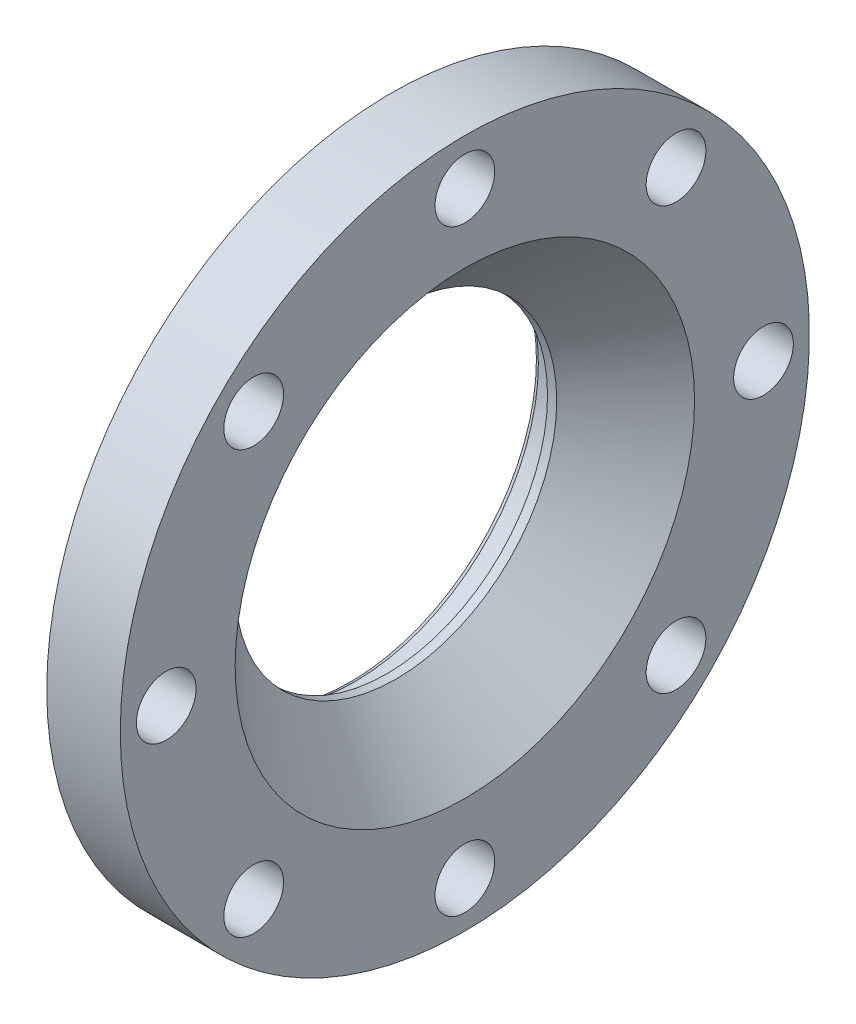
ISO-10303-21;
HEADER;
FILE_DESCRIPTION(('STEP AP214'),'2;1');
FILE_NAME('part.step','',(''),(''),'','','');
FILE_SCHEMA(('AUTOMOTIVE_DESIGN { 1 0 10303 214 1 1 1 1 }'));
ENDSEC;
DATA;
#1=APPLICATION_CONTEXT('core data for automotive mechanical design processes');
#2=APPLICATION_PROTOCOL_DEFINITION('international standard','automotive_design',2000,#1);
#3=PRODUCT_CONTEXT('',#1,'mechanical');
#4=PRODUCT('Part','Part','',(#3));
#5=PRODUCT_RELATED_PRODUCT_CATEGORY('part','',(#4));
#6=PRODUCT_DEFINITION_FORMATION('','',#4);
#7=PRODUCT_DEFINITION_CONTEXT('part definition',#1,'design');
#8=PRODUCT_DEFINITION('design','',#6,#7);
#9=PRODUCT_DEFINITION_SHAPE('','',#8);
#10=(LENGTH_UNIT() NAMED_UNIT(*) SI_UNIT(.MILLI.,.METRE.));
#11=(NAMED_UNIT(*) PLANE_ANGLE_UNIT() SI_UNIT($,.RADIAN.));
#12=(NAMED_UNIT(*) SI_UNIT($,.STERADIAN.) SOLID_ANGLE_UNIT());
#13=UNCERTAINTY_MEASURE_WITH_UNIT(LENGTH_MEASURE(1.E-05),#10,'distance_accuracy_value','');
#14=(GEOMETRIC_REPRESENTATION_CONTEXT(3) GLOBAL_UNCERTAINTY_ASSIGNED_CONTEXT((#13)) GLOBAL_UNIT_ASSIGNED_CONTEXT((#10,
#11,#12)) REPRESENTATION_CONTEXT('',''));
#15=CARTESIAN_POINT('',(0.,0.,0.));
#16=DIRECTION('',(0.,0.,1.));
#17=DIRECTION('',(1.,0.,0.));
#18=AXIS2_PLACEMENT_3D('',#15,#16,#17);
#19=CARTESIAN_POINT('',(0.,0.,0.));
#20=DIRECTION('',(-1.,0.,0.));
#21=DIRECTION('',(0.,0.,1.));
#22=AXIS2_PLACEMENT_3D('',#19,#20,#21);
#23=CYLINDRICAL_SURFACE('',#22,55.);
#24=CARTESIAN_POINT('',(0.,0.,0.));
#25=DIRECTION('',(-1.,0.,0.));
#26=DIRECTION('',(0.,0.,1.));
#27=AXIS2_PLACEMENT_3D('',#24,#25,#26);
#28=CIRCLE('',#27,55.);
#29=CARTESIAN_POINT('',(0.,0.,55.));
#30=VERTEX_POINT('',#29);
#31=EDGE_CURVE('E39',#30,#30,#28,.T.);
#32=ORIENTED_EDGE('',*,*,#31,.F.);
#33=EDGE_LOOP('',(#32));
#34=FACE_BOUND('',#33,.T.);
#35=CARTESIAN_POINT('',(3.,0.,0.));
#36=DIRECTION('',(-1.,0.,0.));
#37=DIRECTION('',(0.,0.,1.));
#38=AXIS2_PLACEMENT_3D('',#35,#36,#37);
#39=CIRCLE('',#38,55.);
#40=CARTESIAN_POINT('',(3.,0.,55.));
#41=VERTEX_POINT('',#40);
#42=EDGE_CURVE('E77',#41,#41,#39,.T.);
#43=ORIENTED_EDGE('',*,*,#42,.T.);
#44=EDGE_LOOP('',(#43));
#45=FACE_BOUND('',#44,.T.);
#46=ADVANCED_FACE('F29',(#34,#45),#23,.T.);
#47=CARTESIAN_POINT('',(0.,47.5,0.));
#48=DIRECTION('',(1.,0.,0.));
#49=DIRECTION('',(0.,0.,-1.));
#50=AXIS2_PLACEMENT_3D('',#47,#48,#49);
#51=PLANE('',#50);
#52=CARTESIAN_POINT('',(0.,0.,0.));
#53=DIRECTION('',(-1.,0.,0.));
#54=DIRECTION('',(0.,0.,1.));
#55=AXIS2_PLACEMENT_3D('',#52,#53,#54);
#56=CIRCLE('',#55,47.5);
#57=CARTESIAN_POINT('',(0.,0.,47.5));
#58=VERTEX_POINT('',#57);
#59=EDGE_CURVE('E43',#58,#58,#56,.T.);
#60=ORIENTED_EDGE('',*,*,#59,.F.);
#61=EDGE_LOOP('',(#60));
#62=FACE_BOUND('',#61,.T.);
#63=ORIENTED_EDGE('',*,*,#31,.T.);
#64=EDGE_LOOP('',(#63));
#65=FACE_BOUND('',#64,.T.);
#66=ADVANCED_FACE('F187',(#62,#65),#51,.F.);
#67=CARTESIAN_POINT('',(0.,0.,0.));
#68=DIRECTION('',(-1.,0.,0.));
#69=DIRECTION('',(0.,0.,1.));
#70=AXIS2_PLACEMENT_3D('',#67,#68,#69);
#71=CYLINDRICAL_SURFACE('',#70,47.5);
#72=CARTESIAN_POINT('',(3.,0.,0.));
#73=DIRECTION('',(-1.,0.,0.));
#74=DIRECTION('',(0.,0.,1.));
#75=AXIS2_PLACEMENT_3D('',#72,#73,#74);
#76=CIRCLE('',#75,47.5);
#77=CARTESIAN_POINT('',(3.,0.,47.5));
#78=VERTEX_POINT('',#77);
#79=EDGE_CURVE('E81',#78,#78,#76,.T.);
#80=ORIENTED_EDGE('',*,*,#79,.F.);
#81=EDGE_LOOP('',(#80));
#82=FACE_BOUND('',#81,.T.);
#83=ORIENTED_EDGE('',*,*,#59,.T.);
#84=EDGE_LOOP('',(#83));
#85=FACE_BOUND('',#84,.T.);
#86=ADVANCED_FACE('F184',(#82,#85),#71,.F.);
#87=CARTESIAN_POINT('',(3.,40.,0.));
#88=DIRECTION('',(1.,0.,0.));
#89=DIRECTION('',(0.,0.,-1.));
#90=AXIS2_PLACEMENT_3D('',#87,#88,#89);
#91=PLANE('',#90);
#92=CARTESIAN_POINT('',(3.,0.,0.));
#93=DIRECTION('',(1.,0.,0.));
#94=DIRECTION('',(0.,0.,-1.));
#95=AXIS2_PLACEMENT_3D('',#92,#93,#94);
#96=CIRCLE('',#95,40.5773502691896);
#97=CARTESIAN_POINT('',(3.,0.,-40.5773502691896));
#98=VERTEX_POINT('',#97);
#99=EDGE_CURVE('E10',#98,#98,#96,.T.);
#100=ORIENTED_EDGE('',*,*,#99,.T.);
#101=EDGE_LOOP('',(#100));
#102=FACE_BOUND('',#101,.T.);
#103=ORIENTED_EDGE('',*,*,#79,.T.);
#104=EDGE_LOOP('',(#103));
#105=FACE_BOUND('',#104,.T.);
#106=ADVANCED_FACE('F179',(#102,#105),#91,.F.);
#107=CARTESIAN_POINT('',(0.,0.,0.));
#108=DIRECTION('',(-1.,0.,0.));
#109=DIRECTION('',(0.,0.,1.));
#110=AXIS2_PLACEMENT_3D('',#107,#108,#109);
#111=CYLINDRICAL_SURFACE('',#110,40.);
#112=CARTESIAN_POINT('',(4.00000000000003,0.,0.));
#113=DIRECTION('',(1.,0.,0.));
#114=DIRECTION('',(0.,0.,-1.));
#115=AXIS2_PLACEMENT_3D('',#112,#113,#114);
#116=CIRCLE('',#115,40.);
#117=CARTESIAN_POINT('',(4.00000000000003,0.,-40.));
#118=VERTEX_POINT('',#117);
#119=EDGE_CURVE('E35',#118,#118,#116,.F.);
#120=ORIENTED_EDGE('',*,*,#119,.T.);
#121=EDGE_LOOP('',(#120));
#122=FACE_BOUND('',#121,.T.);
#123=CARTESIAN_POINT('',(11.,0.,0.));
#124=DIRECTION('',(-1.,0.,0.));
#125=DIRECTION('',(0.,0.,1.));
#126=AXIS2_PLACEMENT_3D('',#123,#124,#125);
#127=CIRCLE('',#126,40.);
#128=CARTESIAN_POINT('',(11.,0.,40.));
#129=VERTEX_POINT('',#128);
#130=EDGE_CURVE('E84',#129,#129,#127,.T.);
#131=ORIENTED_EDGE('',*,*,#130,.F.);
#132=EDGE_LOOP('',(#131));
#133=FACE_BOUND('',#132,.T.);
#134=ADVANCED_FACE('F174',(#122,#133),#111,.F.);
#135=CARTESIAN_POINT('',(11.,35.,0.));
#136=DIRECTION('',(1.,0.,0.));
#137=DIRECTION('',(0.,0.,-1.));
#138=AXIS2_PLACEMENT_3D('',#135,#136,#137);
#139=PLANE('',#138);
#140=CARTESIAN_POINT('',(11.,0.,0.));
#141=DIRECTION('',(-1.,0.,0.));
#142=DIRECTION('',(0.,0.,1.));
#143=AXIS2_PLACEMENT_3D('',#140,#141,#142);
#144=CIRCLE('',#143,35.);
#145=CARTESIAN_POINT('',(11.,0.,35.));
#146=VERTEX_POINT('',#145);
#147=EDGE_CURVE('E87',#146,#146,#144,.T.);
#148=ORIENTED_EDGE('',*,*,#147,.F.);
#149=EDGE_LOOP('',(#148));
#150=FACE_BOUND('',#149,.T.);
#151=ORIENTED_EDGE('',*,*,#130,.T.);
#152=EDGE_LOOP('',(#151));
#153=FACE_BOUND('',#152,.T.);
#154=ADVANCED_FACE('F168',(#150,#153),#139,.F.);
#155=CARTESIAN_POINT('',(0.,0.,0.));
#156=DIRECTION('',(-1.,0.,0.));
#157=DIRECTION('',(0.,0.,1.));
#158=AXIS2_PLACEMENT_3D('',#155,#156,#157);
#159=CYLINDRICAL_SURFACE('',#158,35.);
#160=CARTESIAN_POINT('',(13.,0.,0.));
#161=DIRECTION('',(-1.,0.,0.));
#162=DIRECTION('',(0.,0.,1.));
#163=AXIS2_PLACEMENT_3D('',#160,#161,#162);
#164=CIRCLE('',#163,35.);
#165=CARTESIAN_POINT('',(13.,0.,35.));
#166=VERTEX_POINT('',#165);
#167=EDGE_CURVE('E90',#166,#166,#164,.T.);
#168=ORIENTED_EDGE('',*,*,#167,.F.);
#169=EDGE_LOOP('',(#168));
#170=FACE_BOUND('',#169,.T.);
#171=ORIENTED_EDGE('',*,*,#147,.T.);
#172=EDGE_LOOP('',(#171));
#173=FACE_BOUND('',#172,.T.);
#174=ADVANCED_FACE('F162',(#170,#173),#159,.F.);
#175=CARTESIAN_POINT('',(13.,0.,0.));
#176=DIRECTION('',(1.,0.,0.));
#177=DIRECTION('',(0.,0.,-1.));
#178=AXIS2_PLACEMENT_3D('',#175,#176,#177);
#179=CONICAL_SURFACE('',#178,35.,0.785398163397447);
#180=CARTESIAN_POINT('',(28.,0.,0.));
#181=DIRECTION('',(-1.,0.,0.));
#182=DIRECTION('',(0.,0.,1.));
#183=AXIS2_PLACEMENT_3D('',#180,#181,#182);
#184=CIRCLE('',#183,50.);
#185=CARTESIAN_POINT('',(28.,0.,50.));
#186=VERTEX_POINT('',#185);
#187=EDGE_CURVE('E93',#186,#186,#184,.T.);
#188=ORIENTED_EDGE('',*,*,#187,.F.);
#189=EDGE_LOOP('',(#188));
#190=FACE_BOUND('',#189,.T.);
#191=ORIENTED_EDGE('',*,*,#167,.T.);
#192=EDGE_LOOP('',(#191));
#193=FACE_BOUND('',#192,.T.);
#194=ADVANCED_FACE('F140',(#190,#193),#179,.F.);
#195=CARTESIAN_POINT('',(28.,75.,0.));
#196=DIRECTION('',(-1.,0.,0.));
#197=DIRECTION('',(0.,0.,1.));
#198=AXIS2_PLACEMENT_3D('',#195,#196,#197);
#199=PLANE('',#198);
#200=CARTESIAN_POINT('',(28.,45.9619407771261,45.961940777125));
#201=DIRECTION('',(1.,0.,0.));
#202=DIRECTION('',(0.,0.,-1.));
#203=AXIS2_PLACEMENT_3D('',#200,#201,#202);
#204=CIRCLE('',#203,6.5);
#205=CARTESIAN_POINT('',(28.,45.9619407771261,39.461940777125));
#206=VERTEX_POINT('',#205);
#207=EDGE_CURVE('E50',#206,#206,#204,.T.);
#208=ORIENTED_EDGE('',*,*,#207,.F.);
#209=EDGE_LOOP('',(#208));
#210=FACE_BOUND('',#209,.T.);
#211=CARTESIAN_POINT('',(28.,6.8083925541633E-13,65.));
#212=DIRECTION('',(1.,0.,0.));
#213=DIRECTION('',(0.,0.,-1.));
#214=AXIS2_PLACEMENT_3D('',#211,#212,#213);
#215=CIRCLE('',#214,6.5);
#216=CARTESIAN_POINT('',(28.,6.8083925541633E-13,58.5));
#217=VERTEX_POINT('',#216);
#218=EDGE_CURVE('E49',#217,#217,#215,.T.);
#219=ORIENTED_EDGE('',*,*,#218,.F.);
#220=EDGE_LOOP('',(#219));
#221=FACE_BOUND('',#220,.T.);
#222=CARTESIAN_POINT('',(28.,-45.9619407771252,45.961940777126));
#223=DIRECTION('',(1.,0.,0.));
#224=DIRECTION('',(0.,0.,-1.));
#225=AXIS2_PLACEMENT_3D('',#222,#223,#224);
#226=CIRCLE('',#225,6.50000000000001);
#227=CARTESIAN_POINT('',(28.,-45.9619407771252,39.461940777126));
#228=VERTEX_POINT('',#227);
#229=EDGE_CURVE('E54',#228,#228,#226,.T.);
#230=ORIENTED_EDGE('',*,*,#229,.F.);
#231=EDGE_LOOP('',(#230));
#232=FACE_BOUND('',#231,.T.);
#233=CARTESIAN_POINT('',(28.,-65.,4.5389283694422E-13));
#234=DIRECTION('',(1.,0.,0.));
#235=DIRECTION('',(0.,0.,-1.));
#236=AXIS2_PLACEMENT_3D('',#233,#234,#235);
#237=CIRCLE('',#236,6.5);
#238=CARTESIAN_POINT('',(28.,-65.,-6.49999999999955));
#239=VERTEX_POINT('',#238);
#240=EDGE_CURVE('E58',#239,#239,#237,.T.);
#241=ORIENTED_EDGE('',*,*,#240,.F.);
#242=EDGE_LOOP('',(#241));
#243=FACE_BOUND('',#242,.T.);
#244=CARTESIAN_POINT('',(28.,-45.9619407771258,-45.9619407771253));
#245=DIRECTION('',(1.,0.,0.));
#246=DIRECTION('',(0.,0.,-1.));
#247=AXIS2_PLACEMENT_3D('',#244,#245,#246);
#248=CIRCLE('',#247,6.5);
#249=CARTESIAN_POINT('',(28.,-45.9619407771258,-52.4619407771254));
#250=VERTEX_POINT('',#249);
#251=EDGE_CURVE('E62',#250,#250,#248,.T.);
#252=ORIENTED_EDGE('',*,*,#251,.F.);
#253=EDGE_LOOP('',(#252));
#254=FACE_BOUND('',#253,.T.);
#255=CARTESIAN_POINT('',(28.,-2.2694641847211E-13,-65.));
#256=DIRECTION('',(1.,0.,0.));
#257=DIRECTION('',(0.,0.,-1.));
#258=AXIS2_PLACEMENT_3D('',#255,#256,#257);
#259=CIRCLE('',#258,6.5);
#260=CARTESIAN_POINT('',(28.,-2.2694641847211E-13,-71.5));
#261=VERTEX_POINT('',#260);
#262=EDGE_CURVE('E66',#261,#261,#259,.T.);
#263=ORIENTED_EDGE('',*,*,#262,.F.);
#264=EDGE_LOOP('',(#263));
#265=FACE_BOUND('',#264,.T.);
#266=CARTESIAN_POINT('',(28.,45.9619407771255,-45.9619407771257));
#267=DIRECTION('',(1.,0.,0.));
#268=DIRECTION('',(0.,0.,-1.));
#269=AXIS2_PLACEMENT_3D('',#266,#267,#268);
#270=CIRCLE('',#269,6.50000000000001);
#271=CARTESIAN_POINT('',(28.,45.9619407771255,-52.4619407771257));
#272=VERTEX_POINT('',#271);
#273=EDGE_CURVE('E70',#272,#272,#270,.T.);
#274=ORIENTED_EDGE('',*,*,#273,.F.);
#275=EDGE_LOOP('',(#274));
#276=FACE_BOUND('',#275,.T.);
#277=CARTESIAN_POINT('',(28.,65.,0.));
#278=DIRECTION('',(1.,0.,0.));
#279=DIRECTION('',(0.,0.,-1.));
#280=AXIS2_PLACEMENT_3D('',#277,#278,#279);
#281=CIRCLE('',#280,6.5);
#282=CARTESIAN_POINT('',(28.,65.,-6.5));
#283=VERTEX_POINT('',#282);
#284=EDGE_CURVE('E74',#283,#283,#281,.T.);
#285=ORIENTED_EDGE('',*,*,#284,.F.);
#286=EDGE_LOOP('',(#285));
#287=FACE_BOUND('',#286,.T.);
#288=CARTESIAN_POINT('',(28.,0.,0.));
#289=DIRECTION('',(-1.,0.,0.));
#290=DIRECTION('',(0.,0.,1.));
#291=AXIS2_PLACEMENT_3D('',#288,#289,#290);
#292=CIRCLE('',#291,75.);
#293=CARTESIAN_POINT('',(28.,0.,75.));
#294=VERTEX_POINT('',#293);
#295=EDGE_CURVE('E96',#294,#294,#292,.T.);
#296=ORIENTED_EDGE('',*,*,#295,.F.);
#297=EDGE_LOOP('',(#296));
#298=FACE_BOUND('',#297,.T.);
#299=ORIENTED_EDGE('',*,*,#187,.T.);
#300=EDGE_LOOP('',(#299));
#301=FACE_BOUND('',#300,.T.);
#302=ADVANCED_FACE('F136',(#210,#221,#232,#243,#254,#265,#276,#287,#298,#301),#199,.F.);
#303=CARTESIAN_POINT('',(0.,0.,0.));
#304=DIRECTION('',(-1.,0.,0.));
#305=DIRECTION('',(0.,0.,1.));
#306=AXIS2_PLACEMENT_3D('',#303,#304,#305);
#307=CYLINDRICAL_SURFACE('',#306,75.);
#308=CARTESIAN_POINT('',(12.,0.,0.));
#309=DIRECTION('',(-1.,0.,0.));
#310=DIRECTION('',(0.,0.,1.));
#311=AXIS2_PLACEMENT_3D('',#308,#309,#310);
#312=CIRCLE('',#311,75.);
#313=CARTESIAN_POINT('',(12.,0.,75.));
#314=VERTEX_POINT('',#313);
#315=EDGE_CURVE('E99',#314,#314,#312,.T.);
#316=ORIENTED_EDGE('',*,*,#315,.F.);
#317=EDGE_LOOP('',(#316));
#318=FACE_BOUND('',#317,.T.);
#319=ORIENTED_EDGE('',*,*,#295,.T.);
#320=EDGE_LOOP('',(#319));
#321=FACE_BOUND('',#320,.T.);
#322=ADVANCED_FACE('F139',(#318,#321),#307,.T.);
#323=CARTESIAN_POINT('',(12.,55.,0.));
#324=DIRECTION('',(1.,0.,0.));
#325=DIRECTION('',(0.,0.,-1.));
#326=AXIS2_PLACEMENT_3D('',#323,#324,#325);
#327=PLANE('',#326);
#328=CARTESIAN_POINT('',(12.,45.9619407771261,45.961940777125));
#329=DIRECTION('',(1.,0.,0.));
#330=DIRECTION('',(0.,0.,-1.));
#331=AXIS2_PLACEMENT_3D('',#328,#329,#330);
#332=CIRCLE('',#331,6.5);
#333=CARTESIAN_POINT('',(12.,45.9619407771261,39.461940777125));
#334=VERTEX_POINT('',#333);
#335=EDGE_CURVE('E46',#334,#334,#332,.T.);
#336=ORIENTED_EDGE('',*,*,#335,.T.);
#337=EDGE_LOOP('',(#336));
#338=FACE_BOUND('',#337,.T.);
#339=CARTESIAN_POINT('',(12.,6.8083925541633E-13,65.));
#340=DIRECTION('',(1.,0.,0.));
#341=DIRECTION('',(0.,0.,-1.));
#342=AXIS2_PLACEMENT_3D('',#339,#340,#341);
#343=CIRCLE('',#342,6.5);
#344=CARTESIAN_POINT('',(12.,6.8083925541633E-13,58.5));
#345=VERTEX_POINT('',#344);
#346=EDGE_CURVE('E51',#345,#345,#343,.T.);
#347=ORIENTED_EDGE('',*,*,#346,.T.);
#348=EDGE_LOOP('',(#347));
#349=FACE_BOUND('',#348,.T.);
#350=CARTESIAN_POINT('',(12.,-45.9619407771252,45.961940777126));
#351=DIRECTION('',(1.,0.,0.));
#352=DIRECTION('',(0.,0.,-1.));
#353=AXIS2_PLACEMENT_3D('',#350,#351,#352);
#354=CIRCLE('',#353,6.50000000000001);
#355=CARTESIAN_POINT('',(12.,-45.9619407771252,39.461940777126));
#356=VERTEX_POINT('',#355);
#357=EDGE_CURVE('E55',#356,#356,#354,.T.);
#358=ORIENTED_EDGE('',*,*,#357,.T.);
#359=EDGE_LOOP('',(#358));
#360=FACE_BOUND('',#359,.T.);
#361=CARTESIAN_POINT('',(12.,-65.,4.5389283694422E-13));
#362=DIRECTION('',(1.,0.,0.));
#363=DIRECTION('',(0.,0.,-1.));
#364=AXIS2_PLACEMENT_3D('',#361,#362,#363);
#365=CIRCLE('',#364,6.5);
#366=CARTESIAN_POINT('',(12.,-65.,-6.49999999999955));
#367=VERTEX_POINT('',#366);
#368=EDGE_CURVE('E59',#367,#367,#365,.T.);
#369=ORIENTED_EDGE('',*,*,#368,.T.);
#370=EDGE_LOOP('',(#369));
#371=FACE_BOUND('',#370,.T.);
#372=CARTESIAN_POINT('',(12.,-45.9619407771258,-45.9619407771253));
#373=DIRECTION('',(1.,0.,0.));
#374=DIRECTION('',(0.,0.,-1.));
#375=AXIS2_PLACEMENT_3D('',#372,#373,#374);
#376=CIRCLE('',#375,6.5);
#377=CARTESIAN_POINT('',(12.,-45.9619407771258,-52.4619407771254));
#378=VERTEX_POINT('',#377);
#379=EDGE_CURVE('E63',#378,#378,#376,.T.);
#380=ORIENTED_EDGE('',*,*,#379,.T.);
#381=EDGE_LOOP('',(#380));
#382=FACE_BOUND('',#381,.T.);
#383=CARTESIAN_POINT('',(12.,-2.2694641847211E-13,-65.));
#384=DIRECTION('',(1.,0.,0.));
#385=DIRECTION('',(0.,0.,-1.));
#386=AXIS2_PLACEMENT_3D('',#383,#384,#385);
#387=CIRCLE('',#386,6.5);
#388=CARTESIAN_POINT('',(12.,-2.2694641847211E-13,-71.5));
#389=VERTEX_POINT('',#388);
#390=EDGE_CURVE('E67',#389,#389,#387,.T.);
#391=ORIENTED_EDGE('',*,*,#390,.T.);
#392=EDGE_LOOP('',(#391));
#393=FACE_BOUND('',#392,.T.);
#394=CARTESIAN_POINT('',(12.,45.9619407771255,-45.9619407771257));
#395=DIRECTION('',(1.,0.,0.));
#396=DIRECTION('',(0.,0.,-1.));
#397=AXIS2_PLACEMENT_3D('',#394,#395,#396);
#398=CIRCLE('',#397,6.50000000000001);
#399=CARTESIAN_POINT('',(12.,45.9619407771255,-52.4619407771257));
#400=VERTEX_POINT('',#399);
#401=EDGE_CURVE('E71',#400,#400,#398,.T.);
#402=ORIENTED_EDGE('',*,*,#401,.T.);
#403=EDGE_LOOP('',(#402));
#404=FACE_BOUND('',#403,.T.);
#405=CARTESIAN_POINT('',(12.,65.,0.));
#406=DIRECTION('',(1.,0.,0.));
#407=DIRECTION('',(0.,0.,-1.));
#408=AXIS2_PLACEMENT_3D('',#405,#406,#407);
#409=CIRCLE('',#408,6.5);
#410=CARTESIAN_POINT('',(12.,65.,-6.5));
#411=VERTEX_POINT('',#410);
#412=EDGE_CURVE('E75',#411,#411,#409,.T.);
#413=ORIENTED_EDGE('',*,*,#412,.T.);
#414=EDGE_LOOP('',(#413));
#415=FACE_BOUND('',#414,.T.);
#416=CARTESIAN_POINT('',(12.,0.,0.));
#417=DIRECTION('',(-1.,0.,0.));
#418=DIRECTION('',(0.,0.,1.));
#419=AXIS2_PLACEMENT_3D('',#416,#417,#418);
#420=CIRCLE('',#419,55.);
#421=CARTESIAN_POINT('',(12.,0.,55.));
#422=VERTEX_POINT('',#421);
#423=EDGE_CURVE('E102',#422,#422,#420,.T.);
#424=ORIENTED_EDGE('',*,*,#423,.F.);
#425=EDGE_LOOP('',(#424));
#426=FACE_BOUND('',#425,.T.);
#427=ORIENTED_EDGE('',*,*,#315,.T.);
#428=EDGE_LOOP('',(#427));
#429=FACE_BOUND('',#428,.T.);
#430=ADVANCED_FACE('F219',(#338,#349,#360,#371,#382,#393,#404,#415,#426,#429),#327,.F.);
#431=CARTESIAN_POINT('',(0.,0.,0.));
#432=DIRECTION('',(-1.,0.,0.));
#433=DIRECTION('',(0.,0.,1.));
#434=AXIS2_PLACEMENT_3D('',#431,#432,#433);
#435=CYLINDRICAL_SURFACE('',#434,55.);
#436=CARTESIAN_POINT('',(7.8,0.,0.));
#437=DIRECTION('',(-1.,0.,0.));
#438=DIRECTION('',(0.,0.,1.));
#439=AXIS2_PLACEMENT_3D('',#436,#437,#438);
#440=CIRCLE('',#439,55.);
#441=CARTESIAN_POINT('',(7.8,0.,55.));
#442=VERTEX_POINT('',#441);
#443=EDGE_CURVE('E105',#442,#442,#440,.T.);
#444=ORIENTED_EDGE('',*,*,#443,.F.);
#445=EDGE_LOOP('',(#444));
#446=FACE_BOUND('',#445,.T.);
#447=ORIENTED_EDGE('',*,*,#423,.T.);
#448=EDGE_LOOP('',(#447));
#449=FACE_BOUND('',#448,.T.);
#450=ADVANCED_FACE('F213',(#446,#449),#435,.T.);
#451=CARTESIAN_POINT('',(7.8,51.9,0.));
#452=DIRECTION('',(1.,0.,0.));
#453=DIRECTION('',(0.,0.,-1.));
#454=AXIS2_PLACEMENT_3D('',#451,#452,#453);
#455=PLANE('',#454);
#456=CARTESIAN_POINT('',(7.8,0.,0.));
#457=DIRECTION('',(-1.,0.,0.));
#458=DIRECTION('',(0.,0.,1.));
#459=AXIS2_PLACEMENT_3D('',#456,#457,#458);
#460=CIRCLE('',#459,51.9);
#461=CARTESIAN_POINT('',(7.8,0.,51.9));
#462=VERTEX_POINT('',#461);
#463=EDGE_CURVE('E108',#462,#462,#460,.T.);
#464=ORIENTED_EDGE('',*,*,#463,.F.);
#465=EDGE_LOOP('',(#464));
#466=FACE_BOUND('',#465,.T.);
#467=ORIENTED_EDGE('',*,*,#443,.T.);
#468=EDGE_LOOP('',(#467));
#469=FACE_BOUND('',#468,.T.);
#470=ADVANCED_FACE('F207',(#466,#469),#455,.F.);
#471=CARTESIAN_POINT('',(0.,0.,0.));
#472=DIRECTION('',(-1.,0.,0.));
#473=DIRECTION('',(0.,0.,1.));
#474=AXIS2_PLACEMENT_3D('',#471,#472,#473);
#475=CYLINDRICAL_SURFACE('',#474,51.9);
#476=CARTESIAN_POINT('',(3.,0.,0.));
#477=DIRECTION('',(-1.,0.,0.));
#478=DIRECTION('',(0.,0.,1.));
#479=AXIS2_PLACEMENT_3D('',#476,#477,#478);
#480=CIRCLE('',#479,51.9);
#481=CARTESIAN_POINT('',(3.,0.,51.9));
#482=VERTEX_POINT('',#481);
#483=EDGE_CURVE('E111',#482,#482,#480,.T.);
#484=ORIENTED_EDGE('',*,*,#483,.F.);
#485=EDGE_LOOP('',(#484));
#486=FACE_BOUND('',#485,.T.);
#487=ORIENTED_EDGE('',*,*,#463,.T.);
#488=EDGE_LOOP('',(#487));
#489=FACE_BOUND('',#488,.T.);
#490=ADVANCED_FACE('F201',(#486,#489),#475,.T.);
#491=CARTESIAN_POINT('',(3.,55.,0.));
#492=DIRECTION('',(-1.,0.,0.));
#493=DIRECTION('',(0.,0.,1.));
#494=AXIS2_PLACEMENT_3D('',#491,#492,#493);
#495=PLANE('',#494);
#496=ORIENTED_EDGE('',*,*,#42,.F.);
#497=EDGE_LOOP('',(#496));
#498=FACE_BOUND('',#497,.T.);
#499=ORIENTED_EDGE('',*,*,#483,.T.);
#500=EDGE_LOOP('',(#499));
#501=FACE_BOUND('',#500,.T.);
#502=ADVANCED_FACE('F197',(#498,#501),#495,.F.);
#503=CARTESIAN_POINT('',(0.,65.,0.));
#504=DIRECTION('',(1.,0.,0.));
#505=DIRECTION('',(0.,0.,-1.));
#506=AXIS2_PLACEMENT_3D('',#503,#504,#505);
#507=CYLINDRICAL_SURFACE('',#506,6.5);
#508=ORIENTED_EDGE('',*,*,#284,.T.);
#509=EDGE_LOOP('',(#508));
#510=FACE_BOUND('',#509,.T.);
#511=ORIENTED_EDGE('',*,*,#412,.F.);
#512=EDGE_LOOP('',(#511));
#513=FACE_BOUND('',#512,.T.);
#514=ADVANCED_FACE('F200',(#510,#513),#507,.F.);
#515=CARTESIAN_POINT('',(0.,45.9619407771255,-45.9619407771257));
#516=DIRECTION('',(1.,0.,0.));
#517=DIRECTION('',(0.,0.,-1.));
#518=AXIS2_PLACEMENT_3D('',#515,#516,#517);
#519=CYLINDRICAL_SURFACE('',#518,6.50000000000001);
#520=ORIENTED_EDGE('',*,*,#273,.T.);
#521=EDGE_LOOP('',(#520));
#522=FACE_BOUND('',#521,.T.);
#523=ORIENTED_EDGE('',*,*,#401,.F.);
#524=EDGE_LOOP('',(#523));
#525=FACE_BOUND('',#524,.T.);
#526=ADVANCED_FACE('F237',(#522,#525),#519,.F.);
#527=CARTESIAN_POINT('',(0.,-2.2694641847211E-13,-65.));
#528=DIRECTION('',(1.,0.,0.));
#529=DIRECTION('',(0.,0.,-1.));
#530=AXIS2_PLACEMENT_3D('',#527,#528,#529);
#531=CYLINDRICAL_SURFACE('',#530,6.5);
#532=ORIENTED_EDGE('',*,*,#262,.T.);
#533=EDGE_LOOP('',(#532));
#534=FACE_BOUND('',#533,.T.);
#535=ORIENTED_EDGE('',*,*,#390,.F.);
#536=EDGE_LOOP('',(#535));
#537=FACE_BOUND('',#536,.T.);
#538=ADVANCED_FACE('F241',(#534,#537),#531,.F.);
#539=CARTESIAN_POINT('',(0.,-45.9619407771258,-45.9619407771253));
#540=DIRECTION('',(1.,0.,0.));
#541=DIRECTION('',(0.,0.,-1.));
#542=AXIS2_PLACEMENT_3D('',#539,#540,#541);
#543=CYLINDRICAL_SURFACE('',#542,6.5);
#544=ORIENTED_EDGE('',*,*,#251,.T.);
#545=EDGE_LOOP('',(#544));
#546=FACE_BOUND('',#545,.T.);
#547=ORIENTED_EDGE('',*,*,#379,.F.);
#548=EDGE_LOOP('',(#547));
#549=FACE_BOUND('',#548,.T.);
#550=ADVANCED_FACE('F245',(#546,#549),#543,.F.);
#551=CARTESIAN_POINT('',(0.,-65.,4.5389283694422E-13));
#552=DIRECTION('',(1.,0.,0.));
#553=DIRECTION('',(0.,0.,-1.));
#554=AXIS2_PLACEMENT_3D('',#551,#552,#553);
#555=CYLINDRICAL_SURFACE('',#554,6.5);
#556=ORIENTED_EDGE('',*,*,#240,.T.);
#557=EDGE_LOOP('',(#556));
#558=FACE_BOUND('',#557,.T.);
#559=ORIENTED_EDGE('',*,*,#368,.F.);
#560=EDGE_LOOP('',(#559));
#561=FACE_BOUND('',#560,.T.);
#562=ADVANCED_FACE('F249',(#558,#561),#555,.F.);
#563=CARTESIAN_POINT('',(0.,-45.9619407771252,45.961940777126));
#564=DIRECTION('',(1.,0.,0.));
#565=DIRECTION('',(0.,0.,-1.));
#566=AXIS2_PLACEMENT_3D('',#563,#564,#565);
#567=CYLINDRICAL_SURFACE('',#566,6.50000000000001);
#568=ORIENTED_EDGE('',*,*,#229,.T.);
#569=EDGE_LOOP('',(#568));
#570=FACE_BOUND('',#569,.T.);
#571=ORIENTED_EDGE('',*,*,#357,.F.);
#572=EDGE_LOOP('',(#571));
#573=FACE_BOUND('',#572,.T.);
#574=ADVANCED_FACE('F253',(#570,#573),#567,.F.);
#575=CARTESIAN_POINT('',(0.,6.8083925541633E-13,65.));
#576=DIRECTION('',(1.,0.,0.));
#577=DIRECTION('',(0.,0.,-1.));
#578=AXIS2_PLACEMENT_3D('',#575,#576,#577);
#579=CYLINDRICAL_SURFACE('',#578,6.5);
#580=ORIENTED_EDGE('',*,*,#218,.T.);
#581=EDGE_LOOP('',(#580));
#582=FACE_BOUND('',#581,.T.);
#583=ORIENTED_EDGE('',*,*,#346,.F.);
#584=EDGE_LOOP('',(#583));
#585=FACE_BOUND('',#584,.T.);
#586=ADVANCED_FACE('F257',(#582,#585),#579,.F.);
#587=CARTESIAN_POINT('',(0.,45.9619407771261,45.961940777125));
#588=DIRECTION('',(1.,0.,0.));
#589=DIRECTION('',(0.,0.,-1.));
#590=AXIS2_PLACEMENT_3D('',#587,#588,#589);
#591=CYLINDRICAL_SURFACE('',#590,6.5);
#592=ORIENTED_EDGE('',*,*,#207,.T.);
#593=EDGE_LOOP('',(#592));
#594=FACE_BOUND('',#593,.T.);
#595=ORIENTED_EDGE('',*,*,#335,.F.);
#596=EDGE_LOOP('',(#595));
#597=FACE_BOUND('',#596,.T.);
#598=ADVANCED_FACE('F133',(#594,#597),#591,.F.);
#599=CARTESIAN_POINT('',(4.00000000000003,0.,0.));
#600=DIRECTION('',(-1.,0.,0.));
#601=DIRECTION('',(0.,0.,1.));
#602=AXIS2_PLACEMENT_3D('',#599,#600,#601);
#603=CONICAL_SURFACE('',#602,40.,0.523598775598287);
#604=ORIENTED_EDGE('',*,*,#99,.F.);
#605=EDGE_LOOP('',(#604));
#606=FACE_BOUND('',#605,.T.);
#607=ORIENTED_EDGE('',*,*,#119,.F.);
#608=EDGE_LOOP('',(#607));
#609=FACE_BOUND('',#608,.T.);
#610=ADVANCED_FACE('F264',(#606,#609),#603,.F.);
#611=CLOSED_SHELL('',(#46,#66,#86,#106,#134,#154,#174,#194,#302,#322,#430,#450,#470,#490,#502,
#514,#526,#538,#550,#562,#574,#586,#598,#610));
#612=MANIFOLD_SOLID_BREP('B2',#611);
#613=ADVANCED_BREP_SHAPE_REPRESENTATION('',(#18,#612),#14);
#614=SHAPE_DEFINITION_REPRESENTATION(#9,#613);
ENDSEC;
END-ISO-10303-21;
